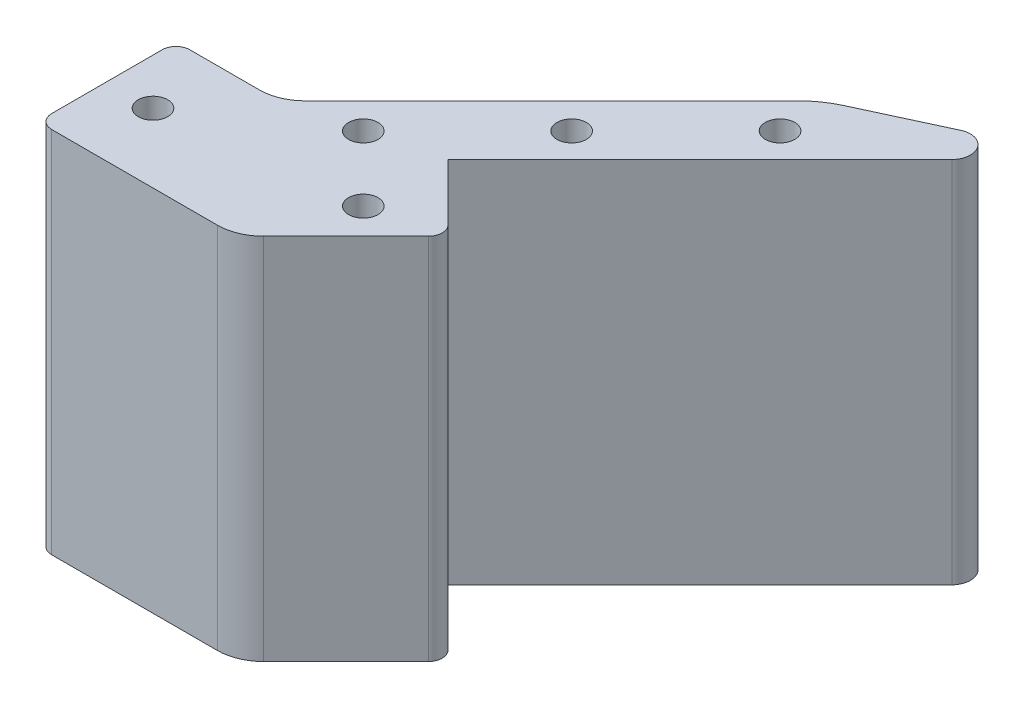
from build123d import *

# Parameters (mm, degrees)
SKETCH_1_R      = 1.6
EXTRUDE_1_DEPTH = 40
FILLET_3_R      = 1.5
FILLET_4_R      = 5


with BuildPart() as part:
    # Sketch 1 → Extrude 1 (new body)
    with BuildSketch(Plane(origin=(0, 0, 0), x_dir=(1, 0, 0), z_dir=(0, 1, 0))):
        with BuildLine():
            Line((-202.638855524, -184.254079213), (-230.884776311, -212.5))
            Line((-230.884776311, -212.5), (-242, -212.5))
            Line((-242, -212.5), (-242, -227.5))
            Line((-242, -227.5), (-220.428932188, -227.5))
            Line((-220.428932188, -227.5), (-208.950053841, -216.021121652))
            Line((-208.950053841, -216.021121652), (-216.162543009, -208.808632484))
            Line((-216.162543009, -208.808632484), (-188.796881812, -181.442971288))
            ThreePointArc((-188.796881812, -181.442971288), (-188.571252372, -178.883805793), (-191.051460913, -178.213878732))
            Line((-191.051460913, -178.213878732), (-199.769615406, -182.250752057))
            ThreePointArc((-199.769615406, -182.250752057), (-201.292547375, -183.125932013), (-202.638855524, -184.254079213))
        make_face()
        with Locations(Location((-237, -220, 0), (0, 0, 270))):
            Circle(SKETCH_1_R, mode=Mode.SUBTRACT)
        with Locations(Location((-200.818325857, -188.090403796, 0), (0, 0, 270))):
            Circle(SKETCH_1_R, mode=Mode.SUBTRACT)
        with Locations(Location((-212.132034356, -199.404112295, 0), (0, 0, 270))):
            Circle(SKETCH_1_R, mode=Mode.SUBTRACT)
        with Locations(Location((-223.445742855, -210.717820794, 0), (0, 0, 270))):
            Circle(SKETCH_1_R, mode=Mode.SUBTRACT)
        with Locations(Location((-216.374675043, -217.788888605, 0), (0, 0, 270))):
            Circle(SKETCH_1_R, mode=Mode.SUBTRACT)
    extrude(amount=EXTRUDE_1_DEPTH)

    # Fillet 3
    fillet_3_edges = [part.edges().sort_by_distance(p)[0] for p in [
        (-208.950053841, 20, 216.021121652),
        (-242, 20, 227.5),
        (-242, 20, 212.5),
    ]]
    fillet(fillet_3_edges, radius=FILLET_3_R)

    # Fillet 4
    fillet_4_edges = [part.edges().sort_by_distance(p)[0] for p in [
        (-220.428932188, 20, 227.5),
        (-230.884776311, 20, 212.5),
    ]]
    fillet(fillet_4_edges, radius=FILLET_4_R)


solid = part.part
